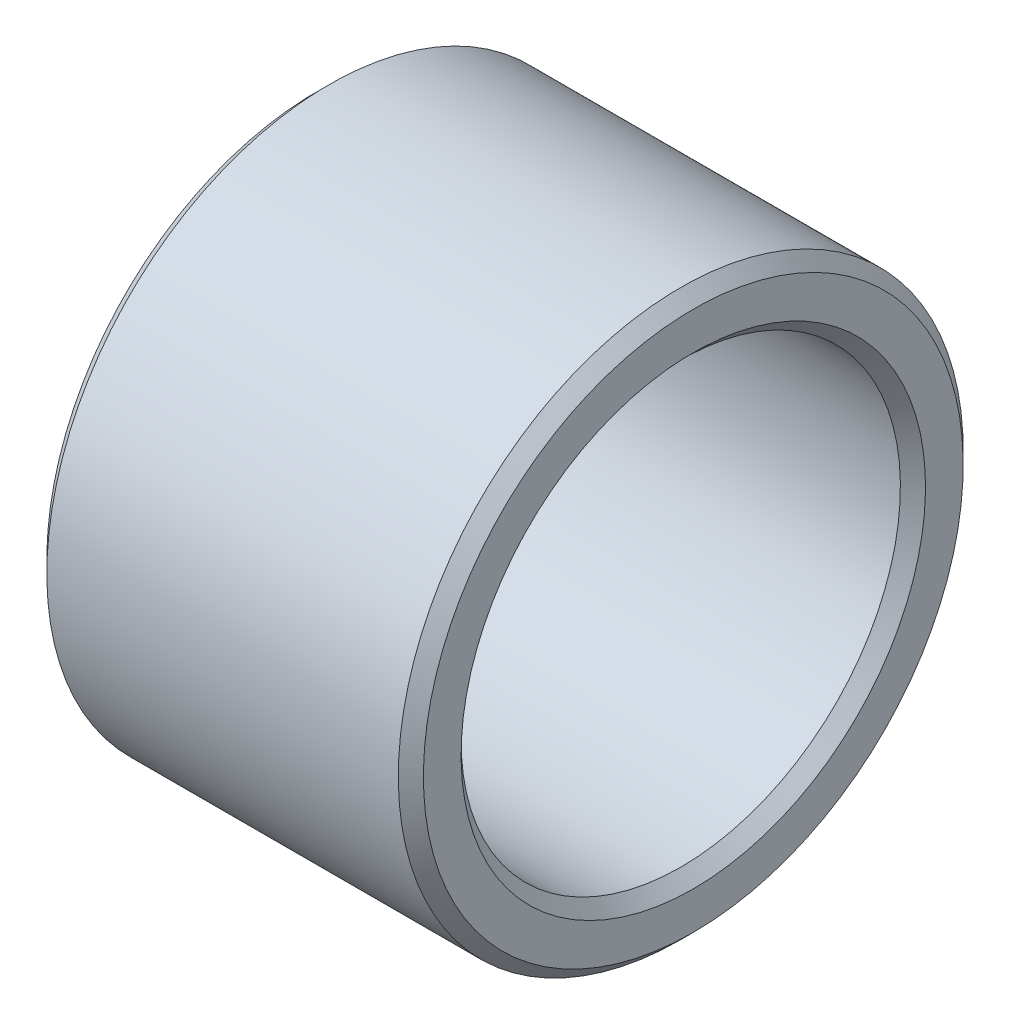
ISO-10303-21;
HEADER;
FILE_DESCRIPTION(('STEP AP214'),'2;1');
FILE_NAME('part.step','',(''),(''),'','','');
FILE_SCHEMA(('AUTOMOTIVE_DESIGN { 1 0 10303 214 1 1 1 1 }'));
ENDSEC;
DATA;
#1=APPLICATION_CONTEXT('core data for automotive mechanical design processes');
#2=APPLICATION_PROTOCOL_DEFINITION('international standard','automotive_design',2000,#1);
#3=PRODUCT_CONTEXT('',#1,'mechanical');
#4=PRODUCT('Part','Part','',(#3));
#5=PRODUCT_RELATED_PRODUCT_CATEGORY('part','',(#4));
#6=PRODUCT_DEFINITION_FORMATION('','',#4);
#7=PRODUCT_DEFINITION_CONTEXT('part definition',#1,'design');
#8=PRODUCT_DEFINITION('design','',#6,#7);
#9=PRODUCT_DEFINITION_SHAPE('','',#8);
#10=(LENGTH_UNIT() NAMED_UNIT(*) SI_UNIT(.MILLI.,.METRE.));
#11=(NAMED_UNIT(*) PLANE_ANGLE_UNIT() SI_UNIT($,.RADIAN.));
#12=(NAMED_UNIT(*) SI_UNIT($,.STERADIAN.) SOLID_ANGLE_UNIT());
#13=UNCERTAINTY_MEASURE_WITH_UNIT(LENGTH_MEASURE(1.E-05),#10,'distance_accuracy_value','');
#14=(GEOMETRIC_REPRESENTATION_CONTEXT(3) GLOBAL_UNCERTAINTY_ASSIGNED_CONTEXT((#13)) GLOBAL_UNIT_ASSIGNED_CONTEXT((#10,
#11,#12)) REPRESENTATION_CONTEXT('',''));
#15=CARTESIAN_POINT('',(0.,0.,0.));
#16=DIRECTION('',(0.,0.,1.));
#17=DIRECTION('',(1.,0.,0.));
#18=AXIS2_PLACEMENT_3D('',#15,#16,#17);
#19=CARTESIAN_POINT('',(0.,-8.,0.));
#20=DIRECTION('',(-1.,0.,0.));
#21=DIRECTION('',(0.,1.,0.));
#22=AXIS2_PLACEMENT_3D('',#19,#20,#21);
#23=PLANE('',#22);
#24=CARTESIAN_POINT('',(0.,0.,0.));
#25=DIRECTION('',(1.,0.,0.));
#26=DIRECTION('',(0.,-1.,0.));
#27=AXIS2_PLACEMENT_3D('',#24,#25,#26);
#28=CIRCLE('',#27,7.4);
#29=CARTESIAN_POINT('',(0.,-7.4,0.));
#30=VERTEX_POINT('',#29);
#31=EDGE_CURVE('E9',#30,#30,#28,.T.);
#32=ORIENTED_EDGE('',*,*,#31,.T.);
#33=EDGE_LOOP('',(#32));
#34=FACE_BOUND('',#33,.T.);
#35=CARTESIAN_POINT('',(0.,0.,0.));
#36=DIRECTION('',(1.,0.,0.));
#37=DIRECTION('',(0.,-1.,0.));
#38=AXIS2_PLACEMENT_3D('',#35,#36,#37);
#39=CIRCLE('',#38,8.6);
#40=CARTESIAN_POINT('',(0.,-8.6,0.));
#41=VERTEX_POINT('',#40);
#42=EDGE_CURVE('E51',#41,#41,#39,.T.);
#43=ORIENTED_EDGE('',*,*,#42,.F.);
#44=EDGE_LOOP('',(#43));
#45=FACE_BOUND('',#44,.T.);
#46=ADVANCED_FACE('F15',(#34,#45),#23,.T.);
#47=CARTESIAN_POINT('',(0.2,0.,0.));
#48=DIRECTION('',(-1.,0.,0.));
#49=DIRECTION('',(0.,-1.,0.));
#50=AXIS2_PLACEMENT_3D('',#47,#48,#49);
#51=CONICAL_SURFACE('',#50,7.2,0.785398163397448);
#52=CARTESIAN_POINT('',(0.4,0.,0.));
#53=DIRECTION('',(1.,0.,0.));
#54=DIRECTION('',(0.,-1.,0.));
#55=AXIS2_PLACEMENT_3D('',#52,#53,#54);
#56=CIRCLE('',#55,7.);
#57=CARTESIAN_POINT('',(0.4,-7.,0.));
#58=VERTEX_POINT('',#57);
#59=EDGE_CURVE('E19',#58,#58,#56,.T.);
#60=ORIENTED_EDGE('',*,*,#59,.T.);
#61=EDGE_LOOP('',(#60));
#62=FACE_BOUND('',#61,.T.);
#63=ORIENTED_EDGE('',*,*,#31,.F.);
#64=EDGE_LOOP('',(#63));
#65=FACE_BOUND('',#64,.T.);
#66=ADVANCED_FACE('F82',(#62,#65),#51,.F.);
#67=CARTESIAN_POINT('',(6.,0.,0.));
#68=DIRECTION('',(-1.,0.,0.));
#69=DIRECTION('',(0.,-1.,0.));
#70=AXIS2_PLACEMENT_3D('',#67,#68,#69);
#71=CYLINDRICAL_SURFACE('',#70,7.);
#72=CARTESIAN_POINT('',(11.6,0.,0.));
#73=DIRECTION('',(1.,0.,0.));
#74=DIRECTION('',(0.,-1.,0.));
#75=AXIS2_PLACEMENT_3D('',#72,#73,#74);
#76=CIRCLE('',#75,7.);
#77=CARTESIAN_POINT('',(11.6,-7.,0.));
#78=VERTEX_POINT('',#77);
#79=EDGE_CURVE('E64',#78,#78,#76,.T.);
#80=ORIENTED_EDGE('',*,*,#79,.T.);
#81=EDGE_LOOP('',(#80));
#82=FACE_BOUND('',#81,.T.);
#83=ORIENTED_EDGE('',*,*,#59,.F.);
#84=EDGE_LOOP('',(#83));
#85=FACE_BOUND('',#84,.T.);
#86=ADVANCED_FACE('F67',(#82,#85),#71,.F.);
#87=CARTESIAN_POINT('',(11.8,0.,0.));
#88=DIRECTION('',(1.,0.,0.));
#89=DIRECTION('',(0.,-1.,0.));
#90=AXIS2_PLACEMENT_3D('',#87,#88,#89);
#91=CONICAL_SURFACE('',#90,7.2,0.785398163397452);
#92=CARTESIAN_POINT('',(12.,0.,0.));
#93=DIRECTION('',(1.,0.,0.));
#94=DIRECTION('',(0.,-1.,0.));
#95=AXIS2_PLACEMENT_3D('',#92,#93,#94);
#96=CIRCLE('',#95,7.4);
#97=CARTESIAN_POINT('',(12.,-7.4,0.));
#98=VERTEX_POINT('',#97);
#99=EDGE_CURVE('E62',#98,#98,#96,.T.);
#100=ORIENTED_EDGE('',*,*,#99,.T.);
#101=EDGE_LOOP('',(#100));
#102=FACE_BOUND('',#101,.T.);
#103=ORIENTED_EDGE('',*,*,#79,.F.);
#104=EDGE_LOOP('',(#103));
#105=FACE_BOUND('',#104,.T.);
#106=ADVANCED_FACE('F70',(#102,#105),#91,.F.);
#107=CARTESIAN_POINT('',(12.,-8.,0.));
#108=DIRECTION('',(1.,0.,0.));
#109=DIRECTION('',(0.,-1.,0.));
#110=AXIS2_PLACEMENT_3D('',#107,#108,#109);
#111=PLANE('',#110);
#112=CARTESIAN_POINT('',(12.,0.,0.));
#113=DIRECTION('',(1.,0.,0.));
#114=DIRECTION('',(0.,-1.,0.));
#115=AXIS2_PLACEMENT_3D('',#112,#113,#114);
#116=CIRCLE('',#115,8.6);
#117=CARTESIAN_POINT('',(12.,-8.6,0.));
#118=VERTEX_POINT('',#117);
#119=EDGE_CURVE('E58',#118,#118,#116,.T.);
#120=ORIENTED_EDGE('',*,*,#119,.T.);
#121=EDGE_LOOP('',(#120));
#122=FACE_BOUND('',#121,.T.);
#123=ORIENTED_EDGE('',*,*,#99,.F.);
#124=EDGE_LOOP('',(#123));
#125=FACE_BOUND('',#124,.T.);
#126=ADVANCED_FACE('F72',(#122,#125),#111,.T.);
#127=CARTESIAN_POINT('',(11.8,0.,0.));
#128=DIRECTION('',(-1.,0.,0.));
#129=DIRECTION('',(0.,-1.,0.));
#130=AXIS2_PLACEMENT_3D('',#127,#128,#129);
#131=CONICAL_SURFACE('',#130,8.8,0.785398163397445);
#132=CARTESIAN_POINT('',(11.6,0.,0.));
#133=DIRECTION('',(1.,0.,0.));
#134=DIRECTION('',(0.,-1.,0.));
#135=AXIS2_PLACEMENT_3D('',#132,#133,#134);
#136=CIRCLE('',#135,9.);
#137=CARTESIAN_POINT('',(11.6,-9.,0.));
#138=VERTEX_POINT('',#137);
#139=EDGE_CURVE('E55',#138,#138,#136,.T.);
#140=ORIENTED_EDGE('',*,*,#139,.T.);
#141=EDGE_LOOP('',(#140));
#142=FACE_BOUND('',#141,.T.);
#143=ORIENTED_EDGE('',*,*,#119,.F.);
#144=EDGE_LOOP('',(#143));
#145=FACE_BOUND('',#144,.T.);
#146=ADVANCED_FACE('F79',(#142,#145),#131,.T.);
#147=CARTESIAN_POINT('',(6.,0.,0.));
#148=DIRECTION('',(-1.,0.,0.));
#149=DIRECTION('',(0.,-1.,0.));
#150=AXIS2_PLACEMENT_3D('',#147,#148,#149);
#151=CYLINDRICAL_SURFACE('',#150,9.);
#152=CARTESIAN_POINT('',(0.4,0.,0.));
#153=DIRECTION('',(1.,0.,0.));
#154=DIRECTION('',(0.,-1.,0.));
#155=AXIS2_PLACEMENT_3D('',#152,#153,#154);
#156=CIRCLE('',#155,9.);
#157=CARTESIAN_POINT('',(0.4,-9.,0.));
#158=VERTEX_POINT('',#157);
#159=EDGE_CURVE('E56',#158,#158,#156,.T.);
#160=ORIENTED_EDGE('',*,*,#159,.T.);
#161=EDGE_LOOP('',(#160));
#162=FACE_BOUND('',#161,.T.);
#163=ORIENTED_EDGE('',*,*,#139,.F.);
#164=EDGE_LOOP('',(#163));
#165=FACE_BOUND('',#164,.T.);
#166=ADVANCED_FACE('F17',(#162,#165),#151,.T.);
#167=CARTESIAN_POINT('',(0.2,0.,0.));
#168=DIRECTION('',(1.,0.,0.));
#169=DIRECTION('',(0.,-1.,0.));
#170=AXIS2_PLACEMENT_3D('',#167,#168,#169);
#171=CONICAL_SURFACE('',#170,8.8,0.785398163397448);
#172=ORIENTED_EDGE('',*,*,#42,.T.);
#173=EDGE_LOOP('',(#172));
#174=FACE_BOUND('',#173,.T.);
#175=ORIENTED_EDGE('',*,*,#159,.F.);
#176=EDGE_LOOP('',(#175));
#177=FACE_BOUND('',#176,.T.);
#178=ADVANCED_FACE('F52',(#174,#177),#171,.T.);
#179=CLOSED_SHELL('',(#46,#66,#86,#106,#126,#146,#166,#178));
#180=MANIFOLD_SOLID_BREP('B1',#179);
#181=ADVANCED_BREP_SHAPE_REPRESENTATION('',(#18,#180),#14);
#182=SHAPE_DEFINITION_REPRESENTATION(#9,#181);
ENDSEC;
END-ISO-10303-21;
